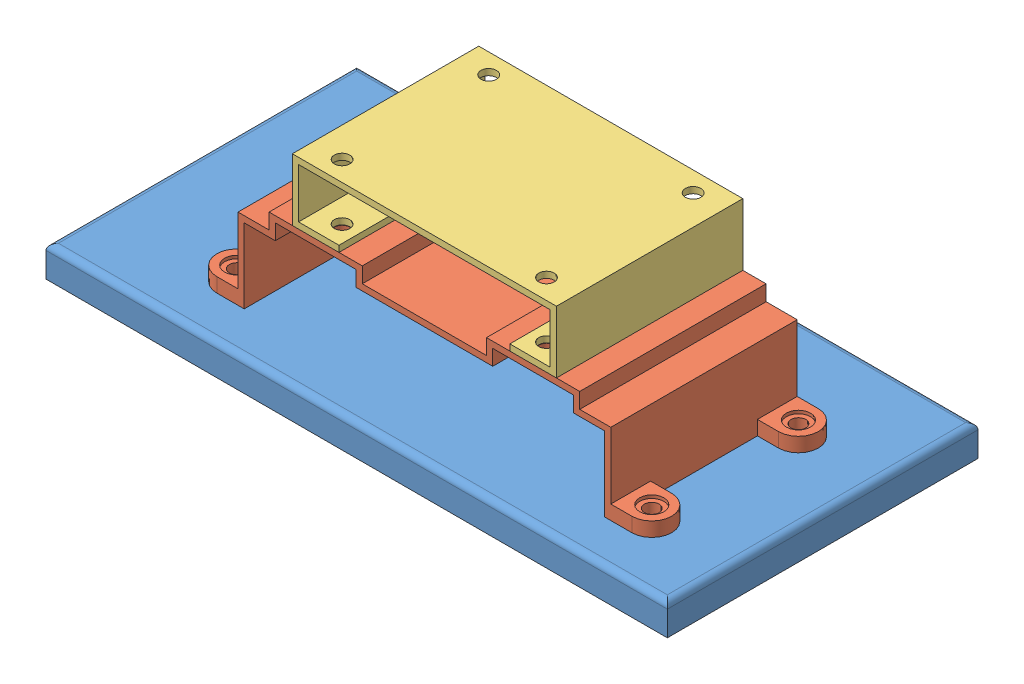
SolidWorks assembly TolAnalyst Stackup Assembly.SLDASM, configuration Default (file format 5000). Lengths in mm.
Overall size (254 77.47 127).
3 component instances, 3 part files, 6 mates.
Components (placement in the parent):
- base-1: base.SLDPRT [Default] at (103.2786 -58.8328 -14.5286) size (254 12.7 127)
- hold_bracket-1: hold_bracket.SLDPRT [Default] at (-13.3074 -46.1328 -108.0006) size (185.93 39.37 76.2)
- Riser-1: Riser.SLDPRT [Default] at (-13.3074 -6.7628 -108.0006) size (107.95 25.4 76.2)
Mates (geometry in assembly coordinates):
- Coincident1: coincident anti-aligned: plane of base-1 through (103.2786 -46.1328 -141.5286) normal (0 1 0); plane of hold_bracket-1 through (62.8926 -46.1328 -31.8006) normal (0 -1 0)
- Parallel1: parallel aligned: plane of base-1 through (103.2786 -46.1328 -141.5286) normal (0 0 -1); plane of hold_bracket-1 through (50.1926 -6.7628 -108.0006) normal (0 0 -1)
- Concentric2: concentric aligned: cylinder of base-1 through (-98.1434 -46.1328 -99.8726) axis (0 1 0) radius 3.175; cylinder of hold_bracket-1 through (-98.1434 -41.5608 -99.8726) axis (0 1 0) radius 3.0226
- Concentric3: concentric anti-aligned: cylinder of hold_bracket-1 through (-55.0904 -46.1329 -39.9286) axis (0 1 0) radius 3.0226; cylinder of Riser-1 through (-55.0904 18.6372 -39.9286) axis (0 -1 0) radius 3.175
- Concentric4: concentric anti-aligned: cylinder of hold_bracket-1 through (28.4756 -46.1329 -39.9286) axis (0 1 0) radius 3.0226; cylinder of Riser-1 through (28.4756 18.6372 -39.9286) axis (0 -1 0) radius 3.175
- Coincident2: coincident anti-aligned: plane of hold_bracket-1 through (-76.8074 -6.7628 -31.8006) normal (0 1 0); plane of Riser-1 through (-48.2324 -6.7628 -31.8006) normal (0 -1 0)
